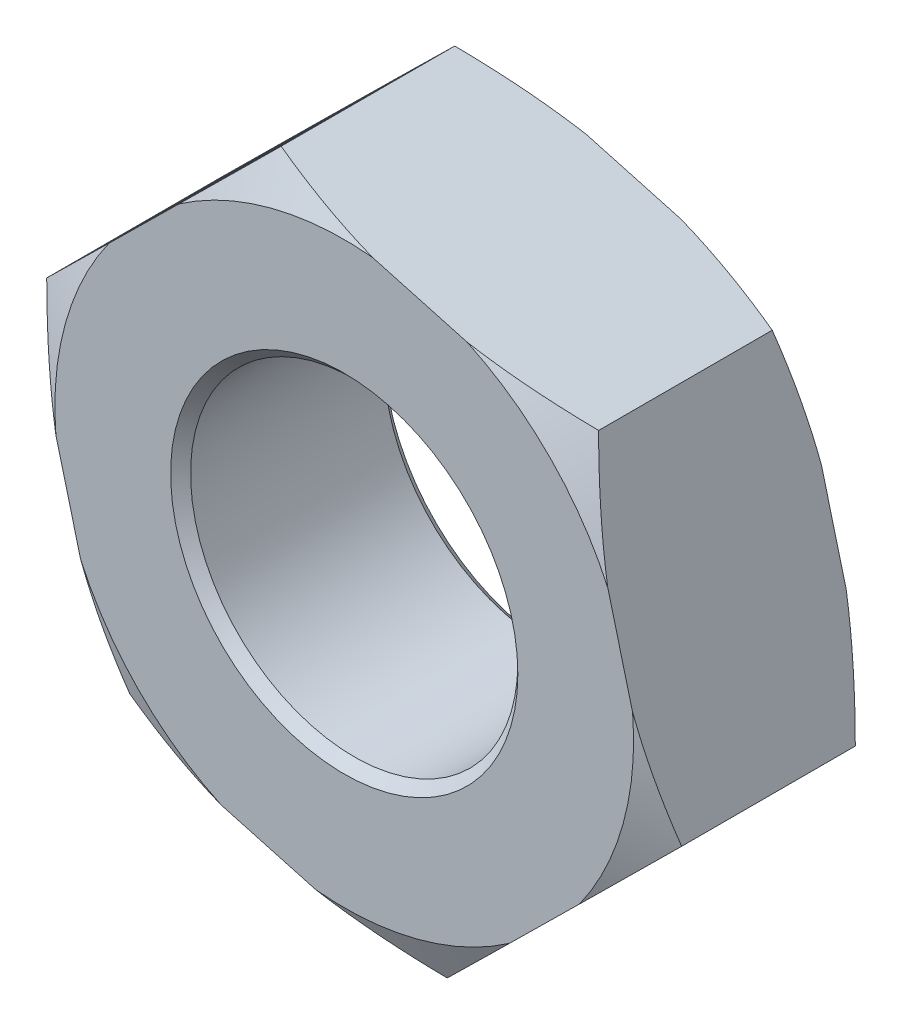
ISO-10303-21;
HEADER;
FILE_DESCRIPTION(('STEP AP214'),'2;1');
FILE_NAME('part.step','',(''),(''),'','','');
FILE_SCHEMA(('AUTOMOTIVE_DESIGN { 1 0 10303 214 1 1 1 1 }'));
ENDSEC;
DATA;
#1=APPLICATION_CONTEXT('core data for automotive mechanical design processes');
#2=APPLICATION_PROTOCOL_DEFINITION('international standard','automotive_design',2000,#1);
#3=PRODUCT_CONTEXT('',#1,'mechanical');
#4=PRODUCT('Part','Part','',(#3));
#5=PRODUCT_RELATED_PRODUCT_CATEGORY('part','',(#4));
#6=PRODUCT_DEFINITION_FORMATION('','',#4);
#7=PRODUCT_DEFINITION_CONTEXT('part definition',#1,'design');
#8=PRODUCT_DEFINITION('design','',#6,#7);
#9=PRODUCT_DEFINITION_SHAPE('','',#8);
#10=(LENGTH_UNIT() NAMED_UNIT(*) SI_UNIT(.MILLI.,.METRE.));
#11=(NAMED_UNIT(*) PLANE_ANGLE_UNIT() SI_UNIT($,.RADIAN.));
#12=(NAMED_UNIT(*) SI_UNIT($,.STERADIAN.) SOLID_ANGLE_UNIT());
#13=UNCERTAINTY_MEASURE_WITH_UNIT(LENGTH_MEASURE(1.E-05),#10,'distance_accuracy_value','');
#14=(GEOMETRIC_REPRESENTATION_CONTEXT(3) GLOBAL_UNCERTAINTY_ASSIGNED_CONTEXT((#13)) GLOBAL_UNIT_ASSIGNED_CONTEXT((#10,
#11,#12)) REPRESENTATION_CONTEXT('',''));
#15=CARTESIAN_POINT('',(0.,0.,0.));
#16=DIRECTION('',(0.,0.,1.));
#17=DIRECTION('',(1.,0.,0.));
#18=AXIS2_PLACEMENT_3D('',#15,#16,#17);
#19=CARTESIAN_POINT('',(0.,0.,5.34999999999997));
#20=DIRECTION('',(0.,0.,1.));
#21=DIRECTION('',(1.,0.,0.));
#22=AXIS2_PLACEMENT_3D('',#19,#20,#21);
#23=PLANE('',#22);
#24=CARTESIAN_POINT('',(0.,0.,5.34999999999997));
#25=DIRECTION('',(0.,0.,1.));
#26=DIRECTION('',(1.,0.,0.));
#27=AXIS2_PLACEMENT_3D('',#24,#25,#26);
#28=CIRCLE('',#27,8.7);
#29=CARTESIAN_POINT('',(8.70000000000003,0.,5.34999999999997));
#30=VERTEX_POINT('',#29);
#31=EDGE_CURVE('E36',#30,#30,#28,.F.);
#32=ORIENTED_EDGE('',*,*,#31,.T.);
#33=EDGE_LOOP('',(#32));
#34=FACE_BOUND('',#33,.T.);
#35=CARTESIAN_POINT('',(0.,0.,5.34999999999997));
#36=DIRECTION('',(0.,0.,1.));
#37=DIRECTION('',(1.,0.,0.));
#38=AXIS2_PLACEMENT_3D('',#35,#36,#37);
#39=CIRCLE('',#38,14.5);
#40=CARTESIAN_POINT('',(11.7876655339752,-8.44398846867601,5.34999999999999));
#41=VERTEX_POINT('',#40);
#42=CARTESIAN_POINT('',(14.4484852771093,1.22117697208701,5.34999999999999));
#43=VERTEX_POINT('',#42);
#44=EDGE_CURVE('E177',#41,#43,#39,.T.);
#45=ORIENTED_EDGE('',*,*,#44,.T.);
#46=DIRECTION('',(-0.252200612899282,0.967674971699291,0.));
#47=VECTOR('',#46,1.);
#48=CARTESIAN_POINT('',(15.9081683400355,-4.37951824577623,5.34999999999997));
#49=LINE('',#48,#47);
#50=CARTESIAN_POINT('',(13.2065412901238,5.98642356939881,5.34999999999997));
#51=VERTEX_POINT('',#50);
#52=EDGE_CURVE('E171',#43,#51,#49,.T.);
#53=ORIENTED_EDGE('',*,*,#52,.T.);
#54=CARTESIAN_POINT('',(6.1666723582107,13.1233437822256,5.34999999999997));
#55=VERTEX_POINT('',#54);
#56=EDGE_CURVE('E169',#51,#55,#39,.T.);
#57=ORIENTED_EDGE('',*,*,#56,.T.);
#58=DIRECTION('',(-0.964131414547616,0.265425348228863,0.));
#59=VECTOR('',#58,1.);
#60=CARTESIAN_POINT('',(11.7468582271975,11.5871187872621,5.34999999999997));
#61=LINE('',#60,#59);
#62=CARTESIAN_POINT('',(1.41887575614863,14.4304120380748,5.34999999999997));
#63=VERTEX_POINT('',#62);
#64=EDGE_CURVE('E43',#55,#63,#61,.T.);
#65=ORIENTED_EDGE('',*,*,#64,.T.);
#66=CARTESIAN_POINT('',(-8.28181291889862,11.9021668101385,5.34999999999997));
#67=VERTEX_POINT('',#66);
#68=EDGE_CURVE('E166',#63,#67,#39,.T.);
#69=ORIENTED_EDGE('',*,*,#68,.T.);
#70=DIRECTION('',(-0.711930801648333,-0.702249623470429,0.));
#71=VECTOR('',#70,1.);
#72=CARTESIAN_POINT('',(-4.16131011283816,15.9666370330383,5.34999999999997));
#73=LINE('',#72,#71);
#74=CARTESIAN_POINT('',(-11.7876655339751,8.443988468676,5.34999999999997));
#75=VERTEX_POINT('',#74);
#76=EDGE_CURVE('E170',#67,#75,#73,.T.);
#77=ORIENTED_EDGE('',*,*,#76,.T.);
#78=CARTESIAN_POINT('',(-14.4484852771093,-1.22117697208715,5.34999999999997));
#79=VERTEX_POINT('',#78);
#80=EDGE_CURVE('E174',#75,#79,#39,.T.);
#81=ORIENTED_EDGE('',*,*,#80,.T.);
#82=DIRECTION('',(0.252200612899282,-0.967674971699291,0.));
#83=VECTOR('',#82,1.);
#84=CARTESIAN_POINT('',(-15.9081683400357,4.37951824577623,5.34999999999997));
#85=LINE('',#84,#83);
#86=CARTESIAN_POINT('',(-13.2065412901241,-5.98642356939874,5.34999999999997));
#87=VERTEX_POINT('',#86);
#88=EDGE_CURVE('E325',#79,#87,#85,.T.);
#89=ORIENTED_EDGE('',*,*,#88,.T.);
#90=CARTESIAN_POINT('',(-6.16667235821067,-13.1233437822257,5.34999999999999));
#91=VERTEX_POINT('',#90);
#92=EDGE_CURVE('E179',#87,#91,#39,.T.);
#93=ORIENTED_EDGE('',*,*,#92,.T.);
#94=DIRECTION('',(0.964131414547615,-0.265425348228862,0.));
#95=VECTOR('',#94,1.);
#96=CARTESIAN_POINT('',(-11.7468582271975,-11.5871187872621,5.34999999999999));
#97=LINE('',#96,#95);
#98=CARTESIAN_POINT('',(-1.41887575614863,-14.4304120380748,5.34999999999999));
#99=VERTEX_POINT('',#98);
#100=EDGE_CURVE('E327',#91,#99,#97,.T.);
#101=ORIENTED_EDGE('',*,*,#100,.T.);
#102=CARTESIAN_POINT('',(8.28181291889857,-11.9021668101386,5.34999999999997));
#103=VERTEX_POINT('',#102);
#104=EDGE_CURVE('E182',#99,#103,#39,.T.);
#105=ORIENTED_EDGE('',*,*,#104,.T.);
#106=DIRECTION('',(0.711930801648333,0.702249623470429,0.));
#107=VECTOR('',#106,1.);
#108=CARTESIAN_POINT('',(4.1613101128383,-15.9666370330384,5.34999999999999));
#109=LINE('',#108,#107);
#110=EDGE_CURVE('E333',#103,#41,#109,.T.);
#111=ORIENTED_EDGE('',*,*,#110,.T.);
#112=EDGE_LOOP('',(#45,#53,#57,#65,#69,#77,#81,#89,#93,#101,#105,#111));
#113=FACE_BOUND('',#112,.T.);
#114=ADVANCED_FACE('F29',(#34,#113),#23,.T.);
#115=CARTESIAN_POINT('',(0.,0.,-5.35000000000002));
#116=DIRECTION('',(0.,0.,1.));
#117=DIRECTION('',(1.,0.,0.));
#118=AXIS2_PLACEMENT_3D('',#115,#116,#117);
#119=PLANE('',#118);
#120=CARTESIAN_POINT('',(0.,0.,-5.35000000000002));
#121=DIRECTION('',(0.,0.,1.));
#122=DIRECTION('',(1.,0.,0.));
#123=AXIS2_PLACEMENT_3D('',#120,#121,#122);
#124=CIRCLE('',#123,8.7);
#125=CARTESIAN_POINT('',(8.69999999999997,0.,-5.35000000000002));
#126=VERTEX_POINT('',#125);
#127=EDGE_CURVE('E11',#126,#126,#124,.T.);
#128=ORIENTED_EDGE('',*,*,#127,.T.);
#129=EDGE_LOOP('',(#128));
#130=FACE_BOUND('',#129,.T.);
#131=DIRECTION('',(-0.252200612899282,0.967674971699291,0.));
#132=VECTOR('',#131,1.);
#133=CARTESIAN_POINT('',(15.9081683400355,-4.37951824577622,-5.35000000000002));
#134=LINE('',#133,#132);
#135=CARTESIAN_POINT('',(14.4484852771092,1.22117697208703,-5.34999999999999));
#136=VERTEX_POINT('',#135);
#137=CARTESIAN_POINT('',(13.2065412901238,5.98642356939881,-5.35000000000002));
#138=VERTEX_POINT('',#137);
#139=EDGE_CURVE('E336',#136,#138,#134,.T.);
#140=ORIENTED_EDGE('',*,*,#139,.F.);
#141=CARTESIAN_POINT('',(0.,0.,-5.35000000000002));
#142=DIRECTION('',(0.,0.,1.));
#143=DIRECTION('',(1.,0.,0.));
#144=AXIS2_PLACEMENT_3D('',#141,#142,#143);
#145=CIRCLE('',#144,14.5);
#146=CARTESIAN_POINT('',(11.7876655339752,-8.44398846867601,-5.34999999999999));
#147=VERTEX_POINT('',#146);
#148=EDGE_CURVE('E176',#136,#147,#145,.F.);
#149=ORIENTED_EDGE('',*,*,#148,.T.);
#150=DIRECTION('',(0.711930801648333,0.702249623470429,0.));
#151=VECTOR('',#150,1.);
#152=CARTESIAN_POINT('',(4.16131011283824,-15.9666370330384,-5.34999999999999));
#153=LINE('',#152,#151);
#154=CARTESIAN_POINT('',(8.28181291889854,-11.9021668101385,-5.35000000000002));
#155=VERTEX_POINT('',#154);
#156=EDGE_CURVE('E345',#155,#147,#153,.T.);
#157=ORIENTED_EDGE('',*,*,#156,.F.);
#158=CARTESIAN_POINT('',(-1.41887575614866,-14.4304120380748,-5.34999999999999));
#159=VERTEX_POINT('',#158);
#160=EDGE_CURVE('E193',#155,#159,#145,.F.);
#161=ORIENTED_EDGE('',*,*,#160,.T.);
#162=DIRECTION('',(0.964131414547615,-0.265425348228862,0.));
#163=VECTOR('',#162,1.);
#164=CARTESIAN_POINT('',(-11.7468582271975,-11.5871187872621,-5.34999999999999));
#165=LINE('',#164,#163);
#166=CARTESIAN_POINT('',(-6.16667235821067,-13.1233437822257,-5.34999999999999));
#167=VERTEX_POINT('',#166);
#168=EDGE_CURVE('E343',#167,#159,#165,.T.);
#169=ORIENTED_EDGE('',*,*,#168,.F.);
#170=CARTESIAN_POINT('',(-13.2065412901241,-5.98642356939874,-5.35000000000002));
#171=VERTEX_POINT('',#170);
#172=EDGE_CURVE('E476',#167,#171,#145,.F.);
#173=ORIENTED_EDGE('',*,*,#172,.T.);
#174=DIRECTION('',(0.252200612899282,-0.967674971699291,0.));
#175=VECTOR('',#174,1.);
#176=CARTESIAN_POINT('',(-15.9081683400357,4.37951824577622,-5.35000000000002));
#177=LINE('',#176,#175);
#178=CARTESIAN_POINT('',(-14.4484852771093,-1.22117697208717,-5.35000000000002));
#179=VERTEX_POINT('',#178);
#180=EDGE_CURVE('E341',#179,#171,#177,.T.);
#181=ORIENTED_EDGE('',*,*,#180,.F.);
#182=CARTESIAN_POINT('',(-11.7876655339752,8.44398846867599,-5.35000000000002));
#183=VERTEX_POINT('',#182);
#184=EDGE_CURVE('E474',#179,#183,#145,.F.);
#185=ORIENTED_EDGE('',*,*,#184,.T.);
#186=DIRECTION('',(-0.711930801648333,-0.702249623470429,0.));
#187=VECTOR('',#186,1.);
#188=CARTESIAN_POINT('',(-4.16131011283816,15.9666370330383,-5.35000000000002));
#189=LINE('',#188,#187);
#190=CARTESIAN_POINT('',(-8.28181291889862,11.9021668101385,-5.35000000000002));
#191=VERTEX_POINT('',#190);
#192=EDGE_CURVE('E339',#191,#183,#189,.T.);
#193=ORIENTED_EDGE('',*,*,#192,.F.);
#194=CARTESIAN_POINT('',(1.41887575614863,14.4304120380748,-5.35000000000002));
#195=VERTEX_POINT('',#194);
#196=EDGE_CURVE('E467',#191,#195,#145,.F.);
#197=ORIENTED_EDGE('',*,*,#196,.T.);
#198=DIRECTION('',(-0.964131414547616,0.265425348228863,0.));
#199=VECTOR('',#198,1.);
#200=CARTESIAN_POINT('',(11.7468582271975,11.5871187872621,-5.34999999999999));
#201=LINE('',#200,#199);
#202=CARTESIAN_POINT('',(6.16667235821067,13.1233437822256,-5.34999999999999));
#203=VERTEX_POINT('',#202);
#204=EDGE_CURVE('E50',#203,#195,#201,.T.);
#205=ORIENTED_EDGE('',*,*,#204,.F.);
#206=EDGE_CURVE('E192',#203,#138,#145,.F.);
#207=ORIENTED_EDGE('',*,*,#206,.T.);
#208=EDGE_LOOP('',(#140,#149,#157,#161,#169,#173,#181,#185,#193,#197,#205,#207));
#209=FACE_BOUND('',#208,.T.);
#210=ADVANCED_FACE('F242',(#130,#209),#119,.F.);
#211=CARTESIAN_POINT('',(0.,0.,5.34999999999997));
#212=DIRECTION('',(0.,0.,-1.));
#213=DIRECTION('',(-1.,0.,0.));
#214=AXIS2_PLACEMENT_3D('',#211,#212,#213);
#215=CONICAL_SURFACE('',#214,14.5,1.10714871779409);
#216=CARTESIAN_POINT('',(11.7859877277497,-8.44564345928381,5.35019999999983));
#217=CARTESIAN_POINT('',(11.9600449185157,-8.27395318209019,5.32946718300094));
#218=CARTESIAN_POINT('',(12.1339120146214,-8.10245041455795,5.30574212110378));
#219=CARTESIAN_POINT('',(12.4811907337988,-7.75989415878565,5.25256007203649));
#220=CARTESIAN_POINT('',(12.6546023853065,-7.58884064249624,5.22310345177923));
#221=CARTESIAN_POINT('',(13.1735019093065,-7.07699736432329,5.12661697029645));
#222=CARTESIAN_POINT('',(13.5182304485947,-6.7369566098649,5.05140022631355));
#223=CARTESIAN_POINT('',(14.2051006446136,-6.05942680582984,4.88155589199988));
#224=CARTESIAN_POINT('',(14.5472430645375,-5.72193700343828,4.78693428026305));
#225=CARTESIAN_POINT('',(15.229498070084,-5.0489596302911,4.58061070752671));
#226=CARTESIAN_POINT('',(15.5696064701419,-4.71347618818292,4.46888132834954));
#227=CARTESIAN_POINT('',(15.9083683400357,-4.37932096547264,4.34992976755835));
#228=B_SPLINE_CURVE_WITH_KNOTS('',3,(#216,#217,#218,#219,#220,#221,#222,#223,#224,#225,#226,
#227),.UNSPECIFIED.,.F.,.F.,(4,2,2,2,2,4),(0.,0.736049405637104,1.47205170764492,
2.94162190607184,4.41074001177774,5.88223776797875),.UNSPECIFIED.);
#229=CARTESIAN_POINT('',(15.9081683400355,-4.37951824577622,4.34999999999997));
#230=VERTEX_POINT('',#229);
#231=EDGE_CURVE('E293',#41,#230,#228,.T.);
#232=ORIENTED_EDGE('',*,*,#231,.T.);
#233=CARTESIAN_POINT('',(15.9082204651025,-4.37971824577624,4.34994832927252));
#234=CARTESIAN_POINT('',(15.7882160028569,-3.91927006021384,4.46889758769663));
#235=CARTESIAN_POINT('',(15.6677345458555,-3.4569916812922,4.58062478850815));
#236=CARTESIAN_POINT('',(15.4260496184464,-2.52966461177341,4.78694435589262));
#237=CARTESIAN_POINT('',(15.3048476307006,-2.06462161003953,4.88156413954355));
#238=CARTESIAN_POINT('',(15.0615278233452,-1.13102162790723,5.05140525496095));
#239=CARTESIAN_POINT('',(14.9394097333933,-0.662463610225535,5.12662060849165));
#240=CARTESIAN_POINT('',(14.7555925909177,0.0428290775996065,5.22310540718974));
#241=CARTESIAN_POINT('',(14.6941625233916,0.278531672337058,5.25256153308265));
#242=CARTESIAN_POINT('',(14.5711410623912,0.750555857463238,5.30574273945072));
#243=CARTESIAN_POINT('',(14.509549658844,0.986877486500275,5.32946745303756));
#244=CARTESIAN_POINT('',(14.4478909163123,1.22345749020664,5.3502));
#245=B_SPLINE_CURVE_WITH_KNOTS('',3,(#233,#234,#235,#236,#237,#238,#239,#240,#241,#242,#243,
#244),.UNSPECIFIED.,.F.,.F.,(4,2,2,2,2,4),(0.,1.47147859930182,2.94057762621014,
4.41012872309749,5.14612143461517,5.88216124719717),.UNSPECIFIED.);
#246=EDGE_CURVE('E297',#230,#43,#245,.T.);
#247=ORIENTED_EDGE('',*,*,#246,.T.);
#248=ORIENTED_EDGE('',*,*,#44,.F.);
#249=EDGE_LOOP('',(#232,#247,#248));
#250=FACE_BOUND('',#249,.T.);
#251=ADVANCED_FACE('F237',(#250),#215,.T.);
#252=CARTESIAN_POINT('',(-1.42114792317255,-14.4297865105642,5.3502));
#253=CARTESIAN_POINT('',(-1.18543422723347,-14.4946784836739,5.32946745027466));
#254=CARTESIAN_POINT('',(-0.949977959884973,-14.5594995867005,5.3057427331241));
#255=CARTESIAN_POINT('',(-0.479682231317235,-14.6889719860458,5.25256151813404));
#256=CARTESIAN_POINT('',(-0.244842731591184,-14.7536232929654,5.22310538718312));
#257=CARTESIAN_POINT('',(0.457867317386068,-14.9470793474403,5.12662057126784));
#258=CARTESIAN_POINT('',(0.924709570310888,-15.0756010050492,5.05140520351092));
#259=CARTESIAN_POINT('',(1.85489089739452,-15.3316798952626,4.88156405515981));
#260=CARTESIAN_POINT('',(2.31823100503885,-15.4592374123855,4.78694425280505));
#261=CARTESIAN_POINT('',(3.24216238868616,-15.7135956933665,4.58062464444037));
#262=CARTESIAN_POINT('',(3.70274799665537,-15.8403948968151,4.46889742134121));
#263=CARTESIAN_POINT('',(4.16151011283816,-15.9666920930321,4.34994813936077));
#264=B_SPLINE_CURVE_WITH_KNOTS('',3,(#252,#253,#254,#255,#256,#257,#258,#259,#260,#261,#262,
#263),.UNSPECIFIED.,.F.,.F.,(4,2,2,2,2,4),(0.,0.736039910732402,1.47203272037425,
2.94158401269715,4.41068323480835,5.88216203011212),.UNSPECIFIED.);
#265=CARTESIAN_POINT('',(4.1613101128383,-15.9666370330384,4.34999999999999));
#266=VERTEX_POINT('',#265);
#267=EDGE_CURVE('E281',#99,#266,#264,.T.);
#268=ORIENTED_EDGE('',*,*,#267,.T.);
#269=CARTESIAN_POINT('',(4.16111011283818,-15.9668343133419,4.34992976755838));
#270=CARTESIAN_POINT('',(4.49987198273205,-15.6326790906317,4.46888132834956));
#271=CARTESIAN_POINT('',(4.83998038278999,-15.2971956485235,4.58061070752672));
#272=CARTESIAN_POINT('',(5.52223538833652,-14.6242182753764,4.78693428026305));
#273=CARTESIAN_POINT('',(5.86437780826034,-14.2867284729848,4.88155589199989));
#274=CARTESIAN_POINT('',(6.55124800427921,-13.6091986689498,5.05140022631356));
#275=CARTESIAN_POINT('',(6.89597654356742,-13.2691579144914,5.12661697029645));
#276=CARTESIAN_POINT('',(7.41487606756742,-12.7573146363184,5.22310345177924));
#277=CARTESIAN_POINT('',(7.58828771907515,-12.586261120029,5.25256007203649));
#278=CARTESIAN_POINT('',(7.93556643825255,-12.2437048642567,5.30574212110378));
#279=CARTESIAN_POINT('',(8.10943353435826,-12.0722020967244,5.32946718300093));
#280=CARTESIAN_POINT('',(8.28349072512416,-11.9005118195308,5.35019999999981));
#281=B_SPLINE_CURVE_WITH_KNOTS('',3,(#269,#270,#271,#272,#273,#274,#275,#276,#277,#278,#279,
#280),.UNSPECIFIED.,.F.,.F.,(4,2,2,2,2,4),(0.,1.471497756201,2.94061586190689,4.4101860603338,
5.14618836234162,5.88223776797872),.UNSPECIFIED.);
#282=EDGE_CURVE('E287',#266,#103,#281,.T.);
#283=ORIENTED_EDGE('',*,*,#282,.T.);
#284=ORIENTED_EDGE('',*,*,#104,.F.);
#285=EDGE_LOOP('',(#268,#283,#284));
#286=FACE_BOUND('',#285,.T.);
#287=ADVANCED_FACE('F241',(#286),#215,.T.);
#288=CARTESIAN_POINT('',(-13.207135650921,-5.98414305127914,5.35019999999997));
#289=CARTESIAN_POINT('',(-13.1454769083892,-6.22072305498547,5.32946745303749));
#290=CARTESIAN_POINT('',(-13.083885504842,-6.45704468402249,5.30574273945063));
#291=CARTESIAN_POINT('',(-12.9608640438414,-6.92906886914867,5.25256153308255));
#292=CARTESIAN_POINT('',(-12.8994339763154,-7.16477146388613,5.22310540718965));
#293=CARTESIAN_POINT('',(-12.7156168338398,-7.87006415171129,5.12662060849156));
#294=CARTESIAN_POINT('',(-12.5934987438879,-8.33862216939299,5.05140525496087));
#295=CARTESIAN_POINT('',(-12.3501789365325,-9.27222215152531,4.88156413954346));
#296=CARTESIAN_POINT('',(-12.2289769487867,-9.73726515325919,4.78694435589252));
#297=CARTESIAN_POINT('',(-11.9872920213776,-10.664592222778,4.58062478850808));
#298=CARTESIAN_POINT('',(-11.8668105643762,-11.1268706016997,4.46889758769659));
#299=CARTESIAN_POINT('',(-11.7468061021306,-11.5873187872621,4.34994832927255));
#300=B_SPLINE_CURVE_WITH_KNOTS('',3,(#288,#289,#290,#291,#292,#293,#294,#295,#296,#297,#298,
#299),.UNSPECIFIED.,.F.,.F.,(4,2,2,2,2,4),(0.,0.736039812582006,1.4720325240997,
2.94158362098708,4.41068264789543,5.88216124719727),.UNSPECIFIED.);
#301=CARTESIAN_POINT('',(-11.7468582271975,-11.5871187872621,4.34999999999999));
#302=VERTEX_POINT('',#301);
#303=EDGE_CURVE('E268',#87,#302,#300,.T.);
#304=ORIENTED_EDGE('',*,*,#303,.T.);
#305=CARTESIAN_POINT('',(-11.7470582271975,-11.5870637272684,4.34994813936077));
#306=CARTESIAN_POINT('',(-11.2882961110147,-11.7133609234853,4.4688974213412));
#307=CARTESIAN_POINT('',(-10.8277105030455,-11.8401601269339,4.58062464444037));
#308=CARTESIAN_POINT('',(-9.90377911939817,-12.094518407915,4.78694425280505));
#309=CARTESIAN_POINT('',(-9.44043901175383,-12.2220759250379,4.88156405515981));
#310=CARTESIAN_POINT('',(-8.51025768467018,-12.4781548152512,5.05140520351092));
#311=CARTESIAN_POINT('',(-8.04341543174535,-12.6066764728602,5.12662057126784));
#312=CARTESIAN_POINT('',(-7.34070538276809,-12.8001325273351,5.22310538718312));
#313=CARTESIAN_POINT('',(-7.10586588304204,-12.8647838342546,5.25256151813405));
#314=CARTESIAN_POINT('',(-6.63557015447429,-12.9942562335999,5.30574273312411));
#315=CARTESIAN_POINT('',(-6.40011388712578,-13.0590773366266,5.32946745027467));
#316=CARTESIAN_POINT('',(-6.16440019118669,-13.1239693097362,5.3502));
#317=B_SPLINE_CURVE_WITH_KNOTS('',3,(#305,#306,#307,#308,#309,#310,#311,#312,#313,#314,#315,
#316),.UNSPECIFIED.,.F.,.F.,(4,2,2,2,2,4),(0.,1.4714787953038,2.94057801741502,4.41012930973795,
5.14612211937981,5.88216203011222),.UNSPECIFIED.);
#318=EDGE_CURVE('E274',#302,#91,#317,.T.);
#319=ORIENTED_EDGE('',*,*,#318,.T.);
#320=ORIENTED_EDGE('',*,*,#92,.F.);
#321=EDGE_LOOP('',(#304,#319,#320));
#322=FACE_BOUND('',#321,.T.);
#323=ADVANCED_FACE('F497',(#322),#215,.T.);
#324=CARTESIAN_POINT('',(-11.7859877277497,8.44564345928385,5.35019999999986));
#325=CARTESIAN_POINT('',(-11.9600449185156,8.27395318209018,5.32946718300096));
#326=CARTESIAN_POINT('',(-12.1339120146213,8.10245041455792,5.3057421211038));
#327=CARTESIAN_POINT('',(-12.4811907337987,7.75989415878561,5.25256007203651));
#328=CARTESIAN_POINT('',(-12.6546023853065,7.5888406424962,5.22310345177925));
#329=CARTESIAN_POINT('',(-13.1735019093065,7.07699736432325,5.12661697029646));
#330=CARTESIAN_POINT('',(-13.5182304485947,6.73695660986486,5.05140022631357));
#331=CARTESIAN_POINT('',(-14.2051006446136,6.05942680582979,4.8815558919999));
#332=CARTESIAN_POINT('',(-14.5472430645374,5.72193700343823,4.78693428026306));
#333=CARTESIAN_POINT('',(-15.2294980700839,5.04895963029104,4.58061070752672));
#334=CARTESIAN_POINT('',(-15.5696064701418,4.71347618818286,4.46888132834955));
#335=CARTESIAN_POINT('',(-15.9083683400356,4.37932096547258,4.34992976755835));
#336=B_SPLINE_CURVE_WITH_KNOTS('',3,(#324,#325,#326,#327,#328,#329,#330,#331,#332,#333,#334,
#335),.UNSPECIFIED.,.F.,.F.,(4,2,2,2,2,4),(0.,0.736049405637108,1.47205170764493,
2.94162190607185,4.41074001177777,5.88223776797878),.UNSPECIFIED.);
#337=CARTESIAN_POINT('',(-15.9081683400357,4.37951824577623,4.34999999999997));
#338=VERTEX_POINT('',#337);
#339=EDGE_CURVE('E256',#75,#338,#336,.T.);
#340=ORIENTED_EDGE('',*,*,#339,.T.);
#341=CARTESIAN_POINT('',(-15.9082204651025,4.37971824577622,4.34994832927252));
#342=CARTESIAN_POINT('',(-15.788216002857,3.91927006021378,4.46889758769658));
#343=CARTESIAN_POINT('',(-15.6677345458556,3.45699168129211,4.58062478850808));
#344=CARTESIAN_POINT('',(-15.4260496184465,2.5296646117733,4.78694435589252));
#345=CARTESIAN_POINT('',(-15.3048476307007,2.06462161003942,4.88156413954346));
#346=CARTESIAN_POINT('',(-15.0615278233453,1.13102162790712,5.05140525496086));
#347=CARTESIAN_POINT('',(-14.9394097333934,0.662463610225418,5.12662060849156));
#348=CARTESIAN_POINT('',(-14.7555925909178,-0.0428290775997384,5.22310540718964));
#349=CARTESIAN_POINT('',(-14.6941625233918,-0.278531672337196,5.25256153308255));
#350=CARTESIAN_POINT('',(-14.5711410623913,-0.750555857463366,5.30574273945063));
#351=CARTESIAN_POINT('',(-14.509549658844,-0.986877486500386,5.32946745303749));
#352=CARTESIAN_POINT('',(-14.4478909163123,-1.22345749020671,5.35019999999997));
#353=B_SPLINE_CURVE_WITH_KNOTS('',3,(#341,#342,#343,#344,#345,#346,#347,#348,#349,#350,#351,
#352),.UNSPECIFIED.,.F.,.F.,(4,2,2,2,2,4),(0.,1.47147859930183,2.94057762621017,
4.41012872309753,5.14612143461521,5.88216124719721),.UNSPECIFIED.);
#354=EDGE_CURVE('E262',#338,#79,#353,.T.);
#355=ORIENTED_EDGE('',*,*,#354,.T.);
#356=ORIENTED_EDGE('',*,*,#80,.F.);
#357=EDGE_LOOP('',(#340,#355,#356));
#358=FACE_BOUND('',#357,.T.);
#359=ADVANCED_FACE('F319',(#358),#215,.T.);
#360=CARTESIAN_POINT('',(1.42114792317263,14.4297865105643,5.35019999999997));
#361=CARTESIAN_POINT('',(1.18543422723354,14.4946784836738,5.32946745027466));
#362=CARTESIAN_POINT('',(0.949977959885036,14.5594995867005,5.30574273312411));
#363=CARTESIAN_POINT('',(0.47968223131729,14.6889719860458,5.25256151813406));
#364=CARTESIAN_POINT('',(0.244842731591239,14.7536232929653,5.22310538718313));
#365=CARTESIAN_POINT('',(-0.457867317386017,14.9470793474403,5.12662057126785));
#366=CARTESIAN_POINT('',(-0.924709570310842,15.0756010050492,5.05140520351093));
#367=CARTESIAN_POINT('',(-1.85489089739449,15.3316798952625,4.88156405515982));
#368=CARTESIAN_POINT('',(-2.31823100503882,15.4592374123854,4.78694425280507));
#369=CARTESIAN_POINT('',(-3.24216238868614,15.7135956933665,4.58062464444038));
#370=CARTESIAN_POINT('',(-3.70274799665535,15.8403948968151,4.4688974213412));
#371=CARTESIAN_POINT('',(-4.16151011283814,15.9666920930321,4.34994813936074));
#372=B_SPLINE_CURVE_WITH_KNOTS('',3,(#360,#361,#362,#363,#364,#365,#366,#367,#368,#369,#370,
#371),.UNSPECIFIED.,.F.,.F.,(4,2,2,2,2,4),(0.,0.73603991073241,1.47203272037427,
2.94158401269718,4.41068323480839,5.88216203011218),.UNSPECIFIED.);
#373=CARTESIAN_POINT('',(-4.16131011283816,15.9666370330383,4.34999999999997));
#374=VERTEX_POINT('',#373);
#375=EDGE_CURVE('E151',#63,#374,#372,.T.);
#376=ORIENTED_EDGE('',*,*,#375,.T.);
#377=CARTESIAN_POINT('',(-4.16111011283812,15.9668343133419,4.34992976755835));
#378=CARTESIAN_POINT('',(-4.49987198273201,15.6326790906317,4.46888132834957));
#379=CARTESIAN_POINT('',(-4.83998038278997,15.2971956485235,4.58061070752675));
#380=CARTESIAN_POINT('',(-5.52223538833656,14.6242182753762,4.78693428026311));
#381=CARTESIAN_POINT('',(-5.86437780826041,14.2867284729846,4.88155589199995));
#382=CARTESIAN_POINT('',(-6.55124800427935,13.6091986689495,5.05140022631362));
#383=CARTESIAN_POINT('',(-6.8959765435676,13.2691579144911,5.12661697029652));
#384=CARTESIAN_POINT('',(-7.41487606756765,12.7573146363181,5.22310345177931));
#385=CARTESIAN_POINT('',(-7.58828771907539,12.5862611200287,5.25256007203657));
#386=CARTESIAN_POINT('',(-7.93556643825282,12.2437048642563,5.30574212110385));
#387=CARTESIAN_POINT('',(-8.10943353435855,12.072202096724,5.32946718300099));
#388=CARTESIAN_POINT('',(-8.28349072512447,11.9005118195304,5.35019999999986));
#389=B_SPLINE_CURVE_WITH_KNOTS('',3,(#377,#378,#379,#380,#381,#382,#383,#384,#385,#386,#387,
#388),.UNSPECIFIED.,.F.,.F.,(4,2,2,2,2,4),(0.,1.47149775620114,2.94061586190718,
4.41018606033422,5.14618836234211,5.88223776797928),.UNSPECIFIED.);
#390=EDGE_CURVE('E158',#374,#67,#389,.T.);
#391=ORIENTED_EDGE('',*,*,#390,.T.);
#392=ORIENTED_EDGE('',*,*,#68,.F.);
#393=EDGE_LOOP('',(#376,#391,#392));
#394=FACE_BOUND('',#393,.T.);
#395=ADVANCED_FACE('F173',(#394),#215,.T.);
#396=ORIENTED_EDGE('',*,*,#56,.F.);
#397=CARTESIAN_POINT('',(13.207135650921,5.98414305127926,5.35019999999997));
#398=CARTESIAN_POINT('',(13.1454769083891,6.22072305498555,5.32946745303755));
#399=CARTESIAN_POINT('',(13.0838855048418,6.45704468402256,5.30574273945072));
#400=CARTESIAN_POINT('',(12.9608640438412,6.92906886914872,5.25256153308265));
#401=CARTESIAN_POINT('',(12.8994339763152,7.16477146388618,5.22310540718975));
#402=CARTESIAN_POINT('',(12.7156168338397,7.87006415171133,5.12662060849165));
#403=CARTESIAN_POINT('',(12.5934987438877,8.33862216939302,5.05140525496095));
#404=CARTESIAN_POINT('',(12.3501789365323,9.27222215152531,4.88156413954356));
#405=CARTESIAN_POINT('',(12.2289769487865,9.73726515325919,4.78694435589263));
#406=CARTESIAN_POINT('',(11.9872920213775,10.664592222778,4.58062478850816));
#407=CARTESIAN_POINT('',(11.8668105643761,11.1268706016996,4.46889758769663));
#408=CARTESIAN_POINT('',(11.7468061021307,11.5873187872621,4.34994832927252));
#409=B_SPLINE_CURVE_WITH_KNOTS('',3,(#397,#398,#399,#400,#401,#402,#403,#404,#405,#406,#407,
#408),.UNSPECIFIED.,.F.,.F.,(4,2,2,2,2,4),(0.,0.736039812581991,1.47203252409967,
2.94158362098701,4.41068264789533,5.88216124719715),.UNSPECIFIED.);
#410=CARTESIAN_POINT('',(11.7468582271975,11.5871187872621,4.34999999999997));
#411=VERTEX_POINT('',#410);
#412=EDGE_CURVE('E183',#51,#411,#409,.T.);
#413=ORIENTED_EDGE('',*,*,#412,.T.);
#414=CARTESIAN_POINT('',(11.7470582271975,11.5870637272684,4.34994813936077));
#415=CARTESIAN_POINT('',(11.2882961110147,11.7133609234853,4.46889742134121));
#416=CARTESIAN_POINT('',(10.8277105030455,11.8401601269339,4.58062464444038));
#417=CARTESIAN_POINT('',(9.90377911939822,12.0945184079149,4.78694425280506));
#418=CARTESIAN_POINT('',(9.4404390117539,12.2220759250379,4.88156405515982));
#419=CARTESIAN_POINT('',(8.51025768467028,12.4781548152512,5.05140520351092));
#420=CARTESIAN_POINT('',(8.04341543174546,12.6066764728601,5.12662057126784));
#421=CARTESIAN_POINT('',(7.34070538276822,12.800132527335,5.22310538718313));
#422=CARTESIAN_POINT('',(7.10586588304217,12.8647838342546,5.25256151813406));
#423=CARTESIAN_POINT('',(6.63557015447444,12.9942562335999,5.30574273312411));
#424=CARTESIAN_POINT('',(6.40011388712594,13.0590773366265,5.32946745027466));
#425=CARTESIAN_POINT('',(6.16440019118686,13.1239693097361,5.35019999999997));
#426=B_SPLINE_CURVE_WITH_KNOTS('',3,(#414,#415,#416,#417,#418,#419,#420,#421,#422,#423,#424,
#425),.UNSPECIFIED.,.F.,.F.,(4,2,2,2,2,4),(0.,1.47147879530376,2.94057801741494,
4.41012930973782,5.14612211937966,5.88216203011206),.UNSPECIFIED.);
#427=EDGE_CURVE('E159',#411,#55,#426,.T.);
#428=ORIENTED_EDGE('',*,*,#427,.T.);
#429=EDGE_LOOP('',(#396,#413,#428));
#430=FACE_BOUND('',#429,.T.);
#431=ADVANCED_FACE('F244',(#430),#215,.T.);
#432=CARTESIAN_POINT('',(0.,0.,-4.35000000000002));
#433=DIRECTION('',(0.,0.,1.));
#434=DIRECTION('',(1.,0.,0.));
#435=AXIS2_PLACEMENT_3D('',#432,#433,#434);
#436=CONICAL_SURFACE('',#435,16.5,1.10714871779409);
#437=ORIENTED_EDGE('',*,*,#148,.F.);
#438=CARTESIAN_POINT('',(14.4478909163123,1.22345749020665,-5.3502));
#439=CARTESIAN_POINT('',(14.509549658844,0.986877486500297,-5.32946745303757));
#440=CARTESIAN_POINT('',(14.5711410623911,0.750555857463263,-5.30574273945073));
#441=CARTESIAN_POINT('',(14.6941625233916,0.278531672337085,-5.25256153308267));
#442=CARTESIAN_POINT('',(14.7555925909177,0.042829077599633,-5.22310540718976));
#443=CARTESIAN_POINT('',(14.9394097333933,-0.662463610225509,-5.12662060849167));
#444=CARTESIAN_POINT('',(15.0615278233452,-1.1310216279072,-5.05140525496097));
#445=CARTESIAN_POINT('',(15.3048476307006,-2.0646216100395,-4.88156413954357));
#446=CARTESIAN_POINT('',(15.4260496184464,-2.52966461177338,-4.78694435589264));
#447=CARTESIAN_POINT('',(15.6677345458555,-3.45699168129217,-4.58062478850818));
#448=CARTESIAN_POINT('',(15.7882160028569,-3.91927006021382,-4.46889758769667));
#449=CARTESIAN_POINT('',(15.9082204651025,-4.37971824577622,-4.34994832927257));
#450=B_SPLINE_CURVE_WITH_KNOTS('',3,(#438,#439,#440,#441,#442,#443,#444,#445,#446,#447,#448,
#449),.UNSPECIFIED.,.F.,.F.,(4,2,2,2,2,4),(0.,0.736039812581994,1.47203252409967,
2.94158362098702,4.41068264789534,5.88216124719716),.UNSPECIFIED.);
#451=CARTESIAN_POINT('',(15.9081683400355,-4.37951824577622,-4.35000000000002));
#452=VERTEX_POINT('',#451);
#453=EDGE_CURVE('E386',#136,#452,#450,.T.);
#454=ORIENTED_EDGE('',*,*,#453,.T.);
#455=CARTESIAN_POINT('',(15.9083683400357,-4.37932096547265,-4.34992976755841));
#456=CARTESIAN_POINT('',(15.5696064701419,-4.71347618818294,-4.46888132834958));
#457=CARTESIAN_POINT('',(15.2294980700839,-5.04895963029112,-4.58061070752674));
#458=CARTESIAN_POINT('',(14.5472430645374,-5.7219370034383,-4.78693428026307));
#459=CARTESIAN_POINT('',(14.2051006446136,-6.05942680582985,-4.88155589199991));
#460=CARTESIAN_POINT('',(13.5182304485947,-6.7369566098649,-5.05140022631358));
#461=CARTESIAN_POINT('',(13.1735019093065,-7.07699736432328,-5.12661697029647));
#462=CARTESIAN_POINT('',(12.6546023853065,-7.58884064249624,-5.22310345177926));
#463=CARTESIAN_POINT('',(12.4811907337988,-7.75989415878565,-5.25256007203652));
#464=CARTESIAN_POINT('',(12.1339120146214,-8.10245041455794,-5.3057421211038));
#465=CARTESIAN_POINT('',(11.9600449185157,-8.27395318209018,-5.32946718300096));
#466=CARTESIAN_POINT('',(11.7859877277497,-8.44564345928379,-5.35019999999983));
#467=B_SPLINE_CURVE_WITH_KNOTS('',3,(#455,#456,#457,#458,#459,#460,#461,#462,#463,#464,#465,
#466),.UNSPECIFIED.,.F.,.F.,(4,2,2,2,2,4),(0.,1.47149775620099,2.94061586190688,
4.41018606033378,5.1461883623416,5.8822377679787),.UNSPECIFIED.);
#468=EDGE_CURVE('E392',#452,#147,#467,.T.);
#469=ORIENTED_EDGE('',*,*,#468,.T.);
#470=EDGE_LOOP('',(#437,#454,#469));
#471=FACE_BOUND('',#470,.T.);
#472=ADVANCED_FACE('F207',(#471),#436,.T.);
#473=ORIENTED_EDGE('',*,*,#160,.F.);
#474=CARTESIAN_POINT('',(8.28349072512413,-11.9005118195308,-5.35019999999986));
#475=CARTESIAN_POINT('',(8.10943353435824,-12.0722020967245,-5.32946718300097));
#476=CARTESIAN_POINT('',(7.93556643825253,-12.2437048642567,-5.30574212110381));
#477=CARTESIAN_POINT('',(7.58828771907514,-12.586261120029,-5.25256007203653));
#478=CARTESIAN_POINT('',(7.41487606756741,-12.7573146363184,-5.22310345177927));
#479=CARTESIAN_POINT('',(6.89597654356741,-13.2691579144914,-5.12661697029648));
#480=CARTESIAN_POINT('',(6.55124800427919,-13.6091986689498,-5.05140022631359));
#481=CARTESIAN_POINT('',(5.86437780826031,-14.2867284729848,-4.88155589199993));
#482=CARTESIAN_POINT('',(5.5222353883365,-14.6242182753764,-4.78693428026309));
#483=CARTESIAN_POINT('',(4.83998038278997,-15.2971956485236,-4.58061070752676));
#484=CARTESIAN_POINT('',(4.49987198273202,-15.6326790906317,-4.46888132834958));
#485=CARTESIAN_POINT('',(4.16111011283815,-15.9668343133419,-4.34992976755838));
#486=B_SPLINE_CURVE_WITH_KNOTS('',3,(#474,#475,#476,#477,#478,#479,#480,#481,#482,#483,#484,
#485),.UNSPECIFIED.,.F.,.F.,(4,2,2,2,2,4),(0.,0.736049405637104,1.47205170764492,
2.94162190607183,4.41074001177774,5.88223776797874),.UNSPECIFIED.);
#487=CARTESIAN_POINT('',(4.16131011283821,-15.9666370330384,-4.34999999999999));
#488=VERTEX_POINT('',#487);
#489=EDGE_CURVE('E398',#155,#488,#486,.T.);
#490=ORIENTED_EDGE('',*,*,#489,.T.);
#491=CARTESIAN_POINT('',(4.16151011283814,-15.9666920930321,-4.34994813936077));
#492=CARTESIAN_POINT('',(3.70274799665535,-15.8403948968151,-4.46889742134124));
#493=CARTESIAN_POINT('',(3.24216238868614,-15.7135956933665,-4.58062464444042));
#494=CARTESIAN_POINT('',(2.31823100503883,-15.4592374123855,-4.78694425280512));
#495=CARTESIAN_POINT('',(1.85489089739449,-15.3316798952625,-4.88156405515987));
#496=CARTESIAN_POINT('',(0.924709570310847,-15.0756010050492,-5.05140520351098));
#497=CARTESIAN_POINT('',(0.457867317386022,-14.9470793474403,-5.1266205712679));
#498=CARTESIAN_POINT('',(-0.244842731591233,-14.7536232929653,-5.22310538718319));
#499=CARTESIAN_POINT('',(-0.479682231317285,-14.6889719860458,-5.25256151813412));
#500=CARTESIAN_POINT('',(-0.949977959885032,-14.5594995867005,-5.30574273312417));
#501=CARTESIAN_POINT('',(-1.18543422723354,-14.4946784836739,-5.32946745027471));
#502=CARTESIAN_POINT('',(-1.42114792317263,-14.4297865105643,-5.3502));
#503=B_SPLINE_CURVE_WITH_KNOTS('',3,(#491,#492,#493,#494,#495,#496,#497,#498,#499,#500,#501,
#502),.UNSPECIFIED.,.F.,.F.,(4,2,2,2,2,4),(0.,1.47147879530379,2.940578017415,4.41012930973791,
5.14612211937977,5.88216203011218),.UNSPECIFIED.);
#504=EDGE_CURVE('E427',#488,#159,#503,.T.);
#505=ORIENTED_EDGE('',*,*,#504,.T.);
#506=EDGE_LOOP('',(#473,#490,#505));
#507=FACE_BOUND('',#506,.T.);
#508=ADVANCED_FACE('F367',(#507),#436,.T.);
#509=ORIENTED_EDGE('',*,*,#172,.F.);
#510=CARTESIAN_POINT('',(-6.16440019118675,-13.1239693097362,-5.3502));
#511=CARTESIAN_POINT('',(-6.40011388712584,-13.0590773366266,-5.32946745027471));
#512=CARTESIAN_POINT('',(-6.63557015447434,-12.9942562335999,-5.30574273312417));
#513=CARTESIAN_POINT('',(-7.10586588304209,-12.8647838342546,-5.25256151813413));
#514=CARTESIAN_POINT('',(-7.34070538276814,-12.8001325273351,-5.2231053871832));
#515=CARTESIAN_POINT('',(-8.04341543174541,-12.6066764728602,-5.12662057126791));
#516=CARTESIAN_POINT('',(-8.51025768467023,-12.4781548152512,-5.05140520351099));
#517=CARTESIAN_POINT('',(-9.44043901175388,-12.2220759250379,-4.88156405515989));
#518=CARTESIAN_POINT('',(-9.90377911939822,-12.094518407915,-4.78694425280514));
#519=CARTESIAN_POINT('',(-10.8277105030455,-11.8401601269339,-4.58062464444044));
#520=CARTESIAN_POINT('',(-11.2882961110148,-11.7133609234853,-4.46889742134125));
#521=CARTESIAN_POINT('',(-11.7470582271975,-11.5870637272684,-4.34994813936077));
#522=B_SPLINE_CURVE_WITH_KNOTS('',3,(#510,#511,#512,#513,#514,#515,#516,#517,#518,#519,#520,
#521),.UNSPECIFIED.,.F.,.F.,(4,2,2,2,2,4),(0.,0.736039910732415,1.47203272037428,
2.94158401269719,4.41068323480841,5.88216203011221),.UNSPECIFIED.);
#523=CARTESIAN_POINT('',(-11.7468582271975,-11.5871187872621,-4.34999999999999));
#524=VERTEX_POINT('',#523);
#525=EDGE_CURVE('E421',#167,#524,#522,.T.);
#526=ORIENTED_EDGE('',*,*,#525,.T.);
#527=CARTESIAN_POINT('',(-11.7468061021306,-11.5873187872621,-4.34994832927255));
#528=CARTESIAN_POINT('',(-11.8668105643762,-11.1268706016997,-4.46889758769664));
#529=CARTESIAN_POINT('',(-11.9872920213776,-10.664592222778,-4.58062478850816));
#530=CARTESIAN_POINT('',(-12.2289769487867,-9.7372651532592,-4.78694435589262));
#531=CARTESIAN_POINT('',(-12.3501789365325,-9.27222215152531,-4.88156413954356));
#532=CARTESIAN_POINT('',(-12.5934987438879,-8.33862216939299,-5.05140525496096));
#533=CARTESIAN_POINT('',(-12.7156168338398,-7.87006415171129,-5.12662060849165));
#534=CARTESIAN_POINT('',(-12.8994339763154,-7.16477146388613,-5.22310540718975));
#535=CARTESIAN_POINT('',(-12.9608640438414,-6.92906886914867,-5.25256153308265));
#536=CARTESIAN_POINT('',(-13.083885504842,-6.4570446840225,-5.30574273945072));
#537=CARTESIAN_POINT('',(-13.1454769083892,-6.22072305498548,-5.32946745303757));
#538=CARTESIAN_POINT('',(-13.207135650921,-5.98414305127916,-5.35020000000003));
#539=B_SPLINE_CURVE_WITH_KNOTS('',3,(#527,#528,#529,#530,#531,#532,#533,#534,#535,#536,#537,
#538),.UNSPECIFIED.,.F.,.F.,(4,2,2,2,2,4),(0.,1.47147859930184,2.94057762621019,
4.41012872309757,5.14612143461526,5.88216124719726),.UNSPECIFIED.);
#540=EDGE_CURVE('E437',#524,#171,#539,.T.);
#541=ORIENTED_EDGE('',*,*,#540,.T.);
#542=EDGE_LOOP('',(#509,#526,#541));
#543=FACE_BOUND('',#542,.T.);
#544=ADVANCED_FACE('F485',(#543),#436,.T.);
#545=ORIENTED_EDGE('',*,*,#184,.F.);
#546=CARTESIAN_POINT('',(-14.4478909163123,-1.22345749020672,-5.35020000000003));
#547=CARTESIAN_POINT('',(-14.509549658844,-0.986877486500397,-5.32946745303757));
#548=CARTESIAN_POINT('',(-14.5711410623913,-0.750555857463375,-5.30574273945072));
#549=CARTESIAN_POINT('',(-14.6941625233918,-0.278531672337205,-5.25256153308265));
#550=CARTESIAN_POINT('',(-14.7555925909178,-0.0428290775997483,-5.22310540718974));
#551=CARTESIAN_POINT('',(-14.9394097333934,0.662463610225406,-5.12662060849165));
#552=CARTESIAN_POINT('',(-15.0615278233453,1.1310216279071,-5.05140525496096));
#553=CARTESIAN_POINT('',(-15.3048476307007,2.06462161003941,-4.88156413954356));
#554=CARTESIAN_POINT('',(-15.4260496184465,2.52966461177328,-4.78694435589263));
#555=CARTESIAN_POINT('',(-15.6677345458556,3.45699168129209,-4.58062478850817));
#556=CARTESIAN_POINT('',(-15.788216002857,3.91927006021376,-4.46889758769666));
#557=CARTESIAN_POINT('',(-15.9082204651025,4.3797182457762,-4.34994832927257));
#558=B_SPLINE_CURVE_WITH_KNOTS('',3,(#546,#547,#548,#549,#550,#551,#552,#553,#554,#555,#556,
#557),.UNSPECIFIED.,.F.,.F.,(4,2,2,2,2,4),(0.,0.736039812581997,1.47203252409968,
2.94158362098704,4.41068264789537,5.8821612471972),.UNSPECIFIED.);
#559=CARTESIAN_POINT('',(-15.9081683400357,4.37951824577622,-4.35000000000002));
#560=VERTEX_POINT('',#559);
#561=EDGE_CURVE('E441',#179,#560,#558,.T.);
#562=ORIENTED_EDGE('',*,*,#561,.T.);
#563=CARTESIAN_POINT('',(-15.9083683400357,4.37932096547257,-4.34992976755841));
#564=CARTESIAN_POINT('',(-15.5696064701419,4.71347618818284,-4.46888132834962));
#565=CARTESIAN_POINT('',(-15.2294980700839,5.04895963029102,-4.5806107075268));
#566=CARTESIAN_POINT('',(-14.5472430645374,5.72193700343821,-4.78693428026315));
#567=CARTESIAN_POINT('',(-14.2051006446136,6.05942680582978,-4.88155589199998));
#568=CARTESIAN_POINT('',(-13.5182304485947,6.73695660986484,-5.05140022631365));
#569=CARTESIAN_POINT('',(-13.1735019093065,7.07699736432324,-5.12661697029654));
#570=CARTESIAN_POINT('',(-12.6546023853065,7.5888406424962,-5.22310345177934));
#571=CARTESIAN_POINT('',(-12.4811907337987,7.75989415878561,-5.2525600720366));
#572=CARTESIAN_POINT('',(-12.1339120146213,8.10245041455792,-5.30574212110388));
#573=CARTESIAN_POINT('',(-11.9600449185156,8.27395318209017,-5.32946718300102));
#574=CARTESIAN_POINT('',(-11.7859877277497,8.44564345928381,-5.35019999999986));
#575=B_SPLINE_CURVE_WITH_KNOTS('',3,(#563,#564,#565,#566,#567,#568,#569,#570,#571,#572,#573,
#574),.UNSPECIFIED.,.F.,.F.,(4,2,2,2,2,4),(0.,1.47149775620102,2.94061586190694,
4.41018606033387,5.1461883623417,5.88223776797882),.UNSPECIFIED.);
#576=EDGE_CURVE('E444',#560,#183,#575,.T.);
#577=ORIENTED_EDGE('',*,*,#576,.T.);
#578=EDGE_LOOP('',(#545,#562,#577));
#579=FACE_BOUND('',#578,.T.);
#580=ADVANCED_FACE('F480',(#579),#436,.T.);
#581=CARTESIAN_POINT('',(6.16440019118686,13.1239693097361,-5.3502));
#582=CARTESIAN_POINT('',(6.40011388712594,13.0590773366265,-5.32946745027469));
#583=CARTESIAN_POINT('',(6.63557015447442,12.9942562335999,-5.30574273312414));
#584=CARTESIAN_POINT('',(7.10586588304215,12.8647838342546,-5.25256151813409));
#585=CARTESIAN_POINT('',(7.34070538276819,12.8001325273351,-5.22310538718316));
#586=CARTESIAN_POINT('',(8.04341543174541,12.6066764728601,-5.12662057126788));
#587=CARTESIAN_POINT('',(8.51025768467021,12.4781548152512,-5.05140520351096));
#588=CARTESIAN_POINT('',(9.44043901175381,12.2220759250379,-4.88156405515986));
#589=CARTESIAN_POINT('',(9.90377911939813,12.094518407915,-4.78694425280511));
#590=CARTESIAN_POINT('',(10.8277105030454,11.8401601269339,-4.58062464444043));
#591=CARTESIAN_POINT('',(11.2882961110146,11.7133609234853,-4.46889742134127));
#592=CARTESIAN_POINT('',(11.7470582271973,11.5870637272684,-4.34994813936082));
#593=B_SPLINE_CURVE_WITH_KNOTS('',3,(#581,#582,#583,#584,#585,#586,#587,#588,#589,#590,#591,
#592),.UNSPECIFIED.,.F.,.F.,(4,2,2,2,2,4),(0.,0.736039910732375,1.47203272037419,
2.94158401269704,4.41068323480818,5.88216203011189),.UNSPECIFIED.);
#594=CARTESIAN_POINT('',(11.7468582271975,11.5871187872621,-4.35000000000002));
#595=VERTEX_POINT('',#594);
#596=EDGE_CURVE('E220',#203,#595,#593,.T.);
#597=ORIENTED_EDGE('',*,*,#596,.T.);
#598=CARTESIAN_POINT('',(11.7468061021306,11.5873187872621,-4.34994832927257));
#599=CARTESIAN_POINT('',(11.8668105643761,11.1268706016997,-4.46889758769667));
#600=CARTESIAN_POINT('',(11.9872920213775,10.664592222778,-4.58062478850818));
#601=CARTESIAN_POINT('',(12.2289769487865,9.73726515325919,-4.78694435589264));
#602=CARTESIAN_POINT('',(12.3501789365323,9.27222215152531,-4.88156413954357));
#603=CARTESIAN_POINT('',(12.5934987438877,8.33862216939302,-5.05140525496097));
#604=CARTESIAN_POINT('',(12.7156168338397,7.87006415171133,-5.12662060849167));
#605=CARTESIAN_POINT('',(12.8994339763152,7.16477146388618,-5.22310540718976));
#606=CARTESIAN_POINT('',(12.9608640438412,6.92906886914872,-5.25256153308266));
#607=CARTESIAN_POINT('',(13.0838855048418,6.45704468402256,-5.30574273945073));
#608=CARTESIAN_POINT('',(13.1454769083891,6.22072305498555,-5.32946745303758));
#609=CARTESIAN_POINT('',(13.2071356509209,5.98414305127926,-5.35020000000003));
#610=B_SPLINE_CURVE_WITH_KNOTS('',3,(#598,#599,#600,#601,#602,#603,#604,#605,#606,#607,#608,
#609),.UNSPECIFIED.,.F.,.F.,(4,2,2,2,2,4),(0.,1.47147859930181,2.94057762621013,
4.41012872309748,5.14612143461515,5.88216124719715),.UNSPECIFIED.);
#611=EDGE_CURVE('E359',#595,#138,#610,.T.);
#612=ORIENTED_EDGE('',*,*,#611,.T.);
#613=ORIENTED_EDGE('',*,*,#206,.F.);
#614=EDGE_LOOP('',(#597,#612,#613));
#615=FACE_BOUND('',#614,.T.);
#616=ADVANCED_FACE('F478',(#615),#436,.T.);
#617=ORIENTED_EDGE('',*,*,#196,.F.);
#618=CARTESIAN_POINT('',(-8.28349072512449,11.9005118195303,-5.35019999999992));
#619=CARTESIAN_POINT('',(-8.10943353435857,12.072202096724,-5.32946718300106));
#620=CARTESIAN_POINT('',(-7.93556643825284,12.2437048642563,-5.30574212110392));
#621=CARTESIAN_POINT('',(-7.58828771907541,12.5862611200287,-5.25256007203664));
#622=CARTESIAN_POINT('',(-7.41487606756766,12.7573146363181,-5.22310345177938));
#623=CARTESIAN_POINT('',(-6.89597654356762,13.2691579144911,-5.12661697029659));
#624=CARTESIAN_POINT('',(-6.55124800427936,13.6091986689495,-5.05140022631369));
#625=CARTESIAN_POINT('',(-5.86437780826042,14.2867284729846,-4.88155589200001));
#626=CARTESIAN_POINT('',(-5.52223538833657,14.6242182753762,-4.78693428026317));
#627=CARTESIAN_POINT('',(-4.83998038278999,15.2971956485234,-4.58061070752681));
#628=CARTESIAN_POINT('',(-4.49987198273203,15.6326790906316,-4.46888132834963));
#629=CARTESIAN_POINT('',(-4.16111011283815,15.9668343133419,-4.34992976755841));
#630=B_SPLINE_CURVE_WITH_KNOTS('',3,(#618,#619,#620,#621,#622,#623,#624,#625,#626,#627,#628,
#629),.UNSPECIFIED.,.F.,.F.,(4,2,2,2,2,4),(0.,0.736049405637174,1.47205170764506,
2.94162190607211,4.41074001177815,5.88223776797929),.UNSPECIFIED.);
#631=CARTESIAN_POINT('',(-4.16131011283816,15.9666370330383,-4.35000000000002));
#632=VERTEX_POINT('',#631);
#633=EDGE_CURVE('E201',#191,#632,#630,.T.);
#634=ORIENTED_EDGE('',*,*,#633,.T.);
#635=CARTESIAN_POINT('',(-4.16151011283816,15.966692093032,-4.34994813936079));
#636=CARTESIAN_POINT('',(-3.70274799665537,15.8403948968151,-4.46889742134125));
#637=CARTESIAN_POINT('',(-3.24216238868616,15.7135956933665,-4.58062464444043));
#638=CARTESIAN_POINT('',(-2.31823100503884,15.4592374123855,-4.78694425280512));
#639=CARTESIAN_POINT('',(-1.85489089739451,15.3316798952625,-4.88156405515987));
#640=CARTESIAN_POINT('',(-0.924709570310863,15.0756010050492,-5.05140520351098));
#641=CARTESIAN_POINT('',(-0.457867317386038,14.9470793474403,-5.1266205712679));
#642=CARTESIAN_POINT('',(0.244842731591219,14.7536232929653,-5.22310538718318));
#643=CARTESIAN_POINT('',(0.479682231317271,14.6889719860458,-5.25256151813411));
#644=CARTESIAN_POINT('',(0.949977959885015,14.5594995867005,-5.30574273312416));
#645=CARTESIAN_POINT('',(1.18543422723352,14.4946784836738,-5.32946745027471));
#646=CARTESIAN_POINT('',(1.42114792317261,14.4297865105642,-5.35020000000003));
#647=B_SPLINE_CURVE_WITH_KNOTS('',3,(#635,#636,#637,#638,#639,#640,#641,#642,#643,#644,#645,
#646),.UNSPECIFIED.,.F.,.F.,(4,2,2,2,2,4),(0.,1.47147879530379,2.940578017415,4.41012930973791,
5.14612211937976,5.88216203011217),.UNSPECIFIED.);
#648=EDGE_CURVE('E194',#632,#195,#647,.T.);
#649=ORIENTED_EDGE('',*,*,#648,.T.);
#650=EDGE_LOOP('',(#617,#634,#649));
#651=FACE_BOUND('',#650,.T.);
#652=ADVANCED_FACE('F369',(#651),#436,.T.);
#653=CARTESIAN_POINT('',(0.,0.,-5.35000000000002));
#654=DIRECTION('',(0.,0.,1.));
#655=DIRECTION('',(1.,0.,0.));
#656=AXIS2_PLACEMENT_3D('',#653,#654,#655);
#657=CYLINDRICAL_SURFACE('',#656,8.2);
#658=CARTESIAN_POINT('',(0.,0.,4.84999999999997));
#659=DIRECTION('',(0.,0.,1.));
#660=DIRECTION('',(1.,0.,0.));
#661=AXIS2_PLACEMENT_3D('',#658,#659,#660);
#662=CIRCLE('',#661,8.2);
#663=CARTESIAN_POINT('',(8.19999999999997,0.,4.84999999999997));
#664=VERTEX_POINT('',#663);
#665=EDGE_CURVE('E379',#664,#664,#662,.T.);
#666=CARTESIAN_POINT('',(0.,0.,-4.85000000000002));
#667=DIRECTION('',(0.,0.,1.));
#668=DIRECTION('',(1.,0.,0.));
#669=AXIS2_PLACEMENT_3D('',#666,#667,#668);
#670=CIRCLE('',#669,8.2);
#671=CARTESIAN_POINT('',(8.19999999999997,0.,-4.85000000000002));
#672=VERTEX_POINT('',#671);
#673=EDGE_CURVE('E381',#672,#672,#670,.F.);
#674=CARTESIAN_POINT('',(8.19999999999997,0.,4.84999999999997));
#675=CARTESIAN_POINT('',(8.19999999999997,0.,4.7489583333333));
#676=CARTESIAN_POINT('',(8.19999999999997,0.,4.64791666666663));
#677=CARTESIAN_POINT('',(8.19999999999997,0.,4.4458333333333));
#678=CARTESIAN_POINT('',(8.19999999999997,0.,4.34479166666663));
#679=CARTESIAN_POINT('',(8.19999999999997,0.,4.1427083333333));
#680=CARTESIAN_POINT('',(8.19999999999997,0.,4.04166666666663));
#681=CARTESIAN_POINT('',(8.19999999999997,0.,3.8395833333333));
#682=CARTESIAN_POINT('',(8.19999999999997,0.,3.73854166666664));
#683=CARTESIAN_POINT('',(8.19999999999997,0.,3.5364583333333));
#684=CARTESIAN_POINT('',(8.19999999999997,0.,3.43541666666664));
#685=CARTESIAN_POINT('',(8.19999999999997,0.,3.2333333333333));
#686=CARTESIAN_POINT('',(8.19999999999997,0.,3.13229166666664));
#687=CARTESIAN_POINT('',(8.19999999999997,0.,2.9302083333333));
#688=CARTESIAN_POINT('',(8.19999999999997,0.,2.82916666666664));
#689=CARTESIAN_POINT('',(8.19999999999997,0.,2.6270833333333));
#690=CARTESIAN_POINT('',(8.19999999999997,0.,2.52604166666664));
#691=CARTESIAN_POINT('',(8.19999999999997,0.,2.3239583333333));
#692=CARTESIAN_POINT('',(8.19999999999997,0.,2.22291666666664));
#693=CARTESIAN_POINT('',(8.19999999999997,0.,2.0208333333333));
#694=CARTESIAN_POINT('',(8.19999999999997,0.,1.91979166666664));
#695=CARTESIAN_POINT('',(8.19999999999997,0.,1.7177083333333));
#696=CARTESIAN_POINT('',(8.19999999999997,0.,1.61666666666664));
#697=CARTESIAN_POINT('',(8.19999999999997,0.,1.4145833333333));
#698=CARTESIAN_POINT('',(8.19999999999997,0.,1.31354166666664));
#699=CARTESIAN_POINT('',(8.19999999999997,0.,1.1114583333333));
#700=CARTESIAN_POINT('',(8.19999999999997,0.,1.01041666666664));
#701=CARTESIAN_POINT('',(8.19999999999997,0.,0.808333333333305));
#702=CARTESIAN_POINT('',(8.19999999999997,0.,0.707291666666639));
#703=CARTESIAN_POINT('',(8.19999999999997,0.,0.505208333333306));
#704=CARTESIAN_POINT('',(8.19999999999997,0.,0.404166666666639));
#705=CARTESIAN_POINT('',(8.19999999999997,0.,0.202083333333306));
#706=CARTESIAN_POINT('',(8.19999999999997,0.,0.10104166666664));
#707=CARTESIAN_POINT('',(8.19999999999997,0.,-0.101041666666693));
#708=CARTESIAN_POINT('',(8.19999999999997,0.,-0.20208333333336));
#709=CARTESIAN_POINT('',(8.19999999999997,0.,-0.404166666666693));
#710=CARTESIAN_POINT('',(8.19999999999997,0.,-0.50520833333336));
#711=CARTESIAN_POINT('',(8.19999999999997,0.,-0.707291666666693));
#712=CARTESIAN_POINT('',(8.19999999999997,0.,-0.808333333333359));
#713=CARTESIAN_POINT('',(8.19999999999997,0.,-1.01041666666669));
#714=CARTESIAN_POINT('',(8.19999999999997,0.,-1.11145833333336));
#715=CARTESIAN_POINT('',(8.19999999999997,0.,-1.31354166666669));
#716=CARTESIAN_POINT('',(8.19999999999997,0.,-1.41458333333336));
#717=CARTESIAN_POINT('',(8.19999999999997,0.,-1.61666666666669));
#718=CARTESIAN_POINT('',(8.19999999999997,0.,-1.71770833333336));
#719=CARTESIAN_POINT('',(8.19999999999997,0.,-1.91979166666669));
#720=CARTESIAN_POINT('',(8.19999999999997,0.,-2.02083333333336));
#721=CARTESIAN_POINT('',(8.19999999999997,0.,-2.22291666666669));
#722=CARTESIAN_POINT('',(8.19999999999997,0.,-2.32395833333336));
#723=CARTESIAN_POINT('',(8.19999999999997,0.,-2.52604166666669));
#724=CARTESIAN_POINT('',(8.19999999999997,0.,-2.62708333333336));
#725=CARTESIAN_POINT('',(8.19999999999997,0.,-2.82916666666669));
#726=CARTESIAN_POINT('',(8.19999999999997,0.,-2.93020833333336));
#727=CARTESIAN_POINT('',(8.19999999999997,0.,-3.13229166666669));
#728=CARTESIAN_POINT('',(8.19999999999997,0.,-3.23333333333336));
#729=CARTESIAN_POINT('',(8.19999999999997,0.,-3.43541666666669));
#730=CARTESIAN_POINT('',(8.19999999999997,0.,-3.53645833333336));
#731=CARTESIAN_POINT('',(8.19999999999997,0.,-3.73854166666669));
#732=CARTESIAN_POINT('',(8.19999999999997,0.,-3.83958333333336));
#733=CARTESIAN_POINT('',(8.19999999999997,0.,-4.04166666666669));
#734=CARTESIAN_POINT('',(8.19999999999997,0.,-4.14270833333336));
#735=CARTESIAN_POINT('',(8.19999999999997,0.,-4.34479166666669));
#736=CARTESIAN_POINT('',(8.19999999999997,0.,-4.44583333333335));
#737=CARTESIAN_POINT('',(8.19999999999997,0.,-4.64791666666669));
#738=CARTESIAN_POINT('',(8.19999999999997,0.,-4.74895833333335));
#739=CARTESIAN_POINT('',(8.19999999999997,0.,-4.85000000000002));
#740=B_SPLINE_CURVE_WITH_KNOTS('',3,(#674,#675,#676,#677,#678,#679,#680,#681,#682,#683,#684,
#685,#686,#687,#688,#689,#690,#691,#692,#693,#694,#695,#696,#697,#698,#699,#700,#701,#702,#703,
#704,#705,#706,#707,#708,#709,#710,#711,#712,#713,#714,#715,#716,#717,#718,#719,#720,#721,#722,
#723,#724,#725,#726,#727,#728,#729,#730,#731,#732,#733,#734,#735,#736,#737,#738,#739),
.UNSPECIFIED.,.F.,.F.,(4,2,2,2,2,2,2,2,2,2,2,2,2,2,2,2,2,2,2,2,2,2,2,2,2,2,2,2,2,2,2,2,4),(0.,
0.303125,0.606249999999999,0.909374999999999,1.2125,1.515625,1.81875,2.121875,2.425,2.728125,
3.03125,3.334375,3.6375,3.940625,4.24375,4.54687499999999,4.84999999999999,5.15312499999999,
5.45624999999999,5.75937499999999,6.06249999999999,6.36562499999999,6.66874999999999,
6.97187499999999,7.27499999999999,7.57812499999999,7.88124999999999,8.18437499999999,
8.48749999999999,8.79062499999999,9.09374999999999,9.39687499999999,9.69999999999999),.UNSPECIFIED.);
#741=EDGE_CURVE('BSEAM245',#664,#672,#740,.T.);
#742=ORIENTED_EDGE('',*,*,#665,.T.);
#743=ORIENTED_EDGE('',*,*,#673,.T.);
#744=ORIENTED_EDGE('',*,*,#741,.T.);
#745=ORIENTED_EDGE('',*,*,#741,.F.);
#746=EDGE_LOOP('',(#742,#744,#743,#745));
#747=FACE_BOUND('',#746,.T.);
#748=ADVANCED_FACE('F245',(#747),#657,.F.);
#749=CARTESIAN_POINT('',(15.9081683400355,-4.37951824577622,-5.35000000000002));
#750=DIRECTION('',(0.967674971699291,0.252200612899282,0.));
#751=DIRECTION('',(-0.252200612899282,0.967674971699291,0.));
#752=AXIS2_PLACEMENT_3D('',#749,#750,#751);
#753=PLANE('',#752);
#754=ORIENTED_EDGE('',*,*,#52,.F.);
#755=ORIENTED_EDGE('',*,*,#246,.F.);
#756=DIRECTION('',(0.,0.,1.));
#757=VECTOR('',#756,1.);
#758=CARTESIAN_POINT('',(15.9081683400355,-4.37951824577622,-5.35000000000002));
#759=LINE('',#758,#757);
#760=EDGE_CURVE('E230',#452,#230,#759,.T.);
#761=ORIENTED_EDGE('',*,*,#760,.F.);
#762=ORIENTED_EDGE('',*,*,#453,.F.);
#763=ORIENTED_EDGE('',*,*,#139,.T.);
#764=ORIENTED_EDGE('',*,*,#611,.F.);
#765=DIRECTION('',(0.,0.,1.));
#766=VECTOR('',#765,1.);
#767=CARTESIAN_POINT('',(11.7468582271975,11.5871187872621,-5.34999999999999));
#768=LINE('',#767,#766);
#769=EDGE_CURVE('E231',#595,#411,#768,.T.);
#770=ORIENTED_EDGE('',*,*,#769,.T.);
#771=ORIENTED_EDGE('',*,*,#412,.F.);
#772=EDGE_LOOP('',(#754,#755,#761,#762,#763,#764,#770,#771));
#773=FACE_BOUND('',#772,.T.);
#774=ADVANCED_FACE('F215',(#773),#753,.T.);
#775=CARTESIAN_POINT('',(4.16131011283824,-15.9666370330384,-5.34999999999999));
#776=DIRECTION('',(0.702249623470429,-0.711930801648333,0.));
#777=DIRECTION('',(0.711930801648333,0.702249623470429,0.));
#778=AXIS2_PLACEMENT_3D('',#775,#776,#777);
#779=PLANE('',#778);
#780=ORIENTED_EDGE('',*,*,#110,.F.);
#781=ORIENTED_EDGE('',*,*,#282,.F.);
#782=DIRECTION('',(0.,0.,1.));
#783=VECTOR('',#782,1.);
#784=CARTESIAN_POINT('',(4.16131011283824,-15.9666370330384,-5.34999999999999));
#785=LINE('',#784,#783);
#786=EDGE_CURVE('E349',#488,#266,#785,.T.);
#787=ORIENTED_EDGE('',*,*,#786,.F.);
#788=ORIENTED_EDGE('',*,*,#489,.F.);
#789=ORIENTED_EDGE('',*,*,#156,.T.);
#790=ORIENTED_EDGE('',*,*,#468,.F.);
#791=ORIENTED_EDGE('',*,*,#760,.T.);
#792=ORIENTED_EDGE('',*,*,#231,.F.);
#793=EDGE_LOOP('',(#780,#781,#787,#788,#789,#790,#791,#792));
#794=FACE_BOUND('',#793,.T.);
#795=ADVANCED_FACE('F403',(#794),#779,.T.);
#796=CARTESIAN_POINT('',(-11.7468582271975,-11.5871187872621,-5.34999999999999));
#797=DIRECTION('',(-0.265425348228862,-0.964131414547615,0.));
#798=DIRECTION('',(0.964131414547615,-0.265425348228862,0.));
#799=AXIS2_PLACEMENT_3D('',#796,#797,#798);
#800=PLANE('',#799);
#801=ORIENTED_EDGE('',*,*,#100,.F.);
#802=ORIENTED_EDGE('',*,*,#318,.F.);
#803=DIRECTION('',(0.,0.,1.));
#804=VECTOR('',#803,1.);
#805=CARTESIAN_POINT('',(-11.7468582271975,-11.5871187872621,-5.34999999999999));
#806=LINE('',#805,#804);
#807=EDGE_CURVE('E352',#524,#302,#806,.T.);
#808=ORIENTED_EDGE('',*,*,#807,.F.);
#809=ORIENTED_EDGE('',*,*,#525,.F.);
#810=ORIENTED_EDGE('',*,*,#168,.T.);
#811=ORIENTED_EDGE('',*,*,#504,.F.);
#812=ORIENTED_EDGE('',*,*,#786,.T.);
#813=ORIENTED_EDGE('',*,*,#267,.F.);
#814=EDGE_LOOP('',(#801,#802,#808,#809,#810,#811,#812,#813));
#815=FACE_BOUND('',#814,.T.);
#816=ADVANCED_FACE('F407',(#815),#800,.T.);
#817=CARTESIAN_POINT('',(-15.9081683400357,4.37951824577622,-5.35000000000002));
#818=DIRECTION('',(-0.967674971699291,-0.252200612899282,0.));
#819=DIRECTION('',(0.252200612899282,-0.967674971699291,0.));
#820=AXIS2_PLACEMENT_3D('',#817,#818,#819);
#821=PLANE('',#820);
#822=ORIENTED_EDGE('',*,*,#88,.F.);
#823=ORIENTED_EDGE('',*,*,#354,.F.);
#824=DIRECTION('',(0.,0.,1.));
#825=VECTOR('',#824,1.);
#826=CARTESIAN_POINT('',(-15.9081683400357,4.37951824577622,-5.35000000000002));
#827=LINE('',#826,#825);
#828=EDGE_CURVE('E323',#560,#338,#827,.T.);
#829=ORIENTED_EDGE('',*,*,#828,.F.);
#830=ORIENTED_EDGE('',*,*,#561,.F.);
#831=ORIENTED_EDGE('',*,*,#180,.T.);
#832=ORIENTED_EDGE('',*,*,#540,.F.);
#833=ORIENTED_EDGE('',*,*,#807,.T.);
#834=ORIENTED_EDGE('',*,*,#303,.F.);
#835=EDGE_LOOP('',(#822,#823,#829,#830,#831,#832,#833,#834));
#836=FACE_BOUND('',#835,.T.);
#837=ADVANCED_FACE('F415',(#836),#821,.T.);
#838=CARTESIAN_POINT('',(-4.16131011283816,15.9666370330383,-5.35000000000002));
#839=DIRECTION('',(-0.702249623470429,0.711930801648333,0.));
#840=DIRECTION('',(-0.711930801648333,-0.702249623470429,0.));
#841=AXIS2_PLACEMENT_3D('',#838,#839,#840);
#842=PLANE('',#841);
#843=ORIENTED_EDGE('',*,*,#76,.F.);
#844=ORIENTED_EDGE('',*,*,#390,.F.);
#845=DIRECTION('',(0.,0.,1.));
#846=VECTOR('',#845,1.);
#847=CARTESIAN_POINT('',(-4.16131011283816,15.9666370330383,-5.35000000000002));
#848=LINE('',#847,#846);
#849=EDGE_CURVE('E154',#632,#374,#848,.T.);
#850=ORIENTED_EDGE('',*,*,#849,.F.);
#851=ORIENTED_EDGE('',*,*,#633,.F.);
#852=ORIENTED_EDGE('',*,*,#192,.T.);
#853=ORIENTED_EDGE('',*,*,#576,.F.);
#854=ORIENTED_EDGE('',*,*,#828,.T.);
#855=ORIENTED_EDGE('',*,*,#339,.F.);
#856=EDGE_LOOP('',(#843,#844,#850,#851,#852,#853,#854,#855));
#857=FACE_BOUND('',#856,.T.);
#858=ADVANCED_FACE('F212',(#857),#842,.T.);
#859=CARTESIAN_POINT('',(11.7468582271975,11.5871187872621,-5.34999999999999));
#860=DIRECTION('',(0.265425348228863,0.964131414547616,0.));
#861=DIRECTION('',(-0.964131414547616,0.265425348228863,0.));
#862=AXIS2_PLACEMENT_3D('',#859,#860,#861);
#863=PLANE('',#862);
#864=ORIENTED_EDGE('',*,*,#64,.F.);
#865=ORIENTED_EDGE('',*,*,#427,.F.);
#866=ORIENTED_EDGE('',*,*,#769,.F.);
#867=ORIENTED_EDGE('',*,*,#596,.F.);
#868=ORIENTED_EDGE('',*,*,#204,.T.);
#869=ORIENTED_EDGE('',*,*,#648,.F.);
#870=ORIENTED_EDGE('',*,*,#849,.T.);
#871=ORIENTED_EDGE('',*,*,#375,.F.);
#872=EDGE_LOOP('',(#864,#865,#866,#867,#868,#869,#870,#871));
#873=FACE_BOUND('',#872,.T.);
#874=ADVANCED_FACE('F152',(#873),#863,.T.);
#875=CARTESIAN_POINT('',(0.,0.,4.84999999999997));
#876=DIRECTION('',(0.,0.,1.));
#877=DIRECTION('',(1.,0.,0.));
#878=AXIS2_PLACEMENT_3D('',#875,#876,#877);
#879=CONICAL_SURFACE('',#878,8.2,0.785398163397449);
#880=CARTESIAN_POINT('',(8.70000000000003,0.,5.34999999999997));
#881=CARTESIAN_POINT('',(8.6947916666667,0.,5.34479166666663));
#882=CARTESIAN_POINT('',(8.68958333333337,0.,5.3395833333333));
#883=CARTESIAN_POINT('',(8.6791666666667,0.,5.32916666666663));
#884=CARTESIAN_POINT('',(8.67395833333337,0.,5.3239583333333));
#885=CARTESIAN_POINT('',(8.6635416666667,0.,5.31354166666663));
#886=CARTESIAN_POINT('',(8.65833333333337,0.,5.3083333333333));
#887=CARTESIAN_POINT('',(8.6479166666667,0.,5.29791666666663));
#888=CARTESIAN_POINT('',(8.64270833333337,0.,5.2927083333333));
#889=CARTESIAN_POINT('',(8.6322916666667,0.,5.28229166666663));
#890=CARTESIAN_POINT('',(8.62708333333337,0.,5.2770833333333));
#891=CARTESIAN_POINT('',(8.6166666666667,0.,5.26666666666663));
#892=CARTESIAN_POINT('',(8.61145833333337,0.,5.2614583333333));
#893=CARTESIAN_POINT('',(8.6010416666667,0.,5.25104166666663));
#894=CARTESIAN_POINT('',(8.59583333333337,0.,5.2458333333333));
#895=CARTESIAN_POINT('',(8.5854166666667,0.,5.23541666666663));
#896=CARTESIAN_POINT('',(8.58020833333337,0.,5.2302083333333));
#897=CARTESIAN_POINT('',(8.5697916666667,0.,5.21979166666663));
#898=CARTESIAN_POINT('',(8.56458333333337,0.,5.2145833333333));
#899=CARTESIAN_POINT('',(8.5541666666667,0.,5.20416666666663));
#900=CARTESIAN_POINT('',(8.54895833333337,0.,5.1989583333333));
#901=CARTESIAN_POINT('',(8.5385416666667,0.,5.18854166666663));
#902=CARTESIAN_POINT('',(8.53333333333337,0.,5.1833333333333));
#903=CARTESIAN_POINT('',(8.5229166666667,0.,5.17291666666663));
#904=CARTESIAN_POINT('',(8.51770833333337,0.,5.1677083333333));
#905=CARTESIAN_POINT('',(8.5072916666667,0.,5.15729166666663));
#906=CARTESIAN_POINT('',(8.50208333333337,0.,5.1520833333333));
#907=CARTESIAN_POINT('',(8.4916666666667,0.,5.14166666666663));
#908=CARTESIAN_POINT('',(8.48645833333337,0.,5.1364583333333));
#909=CARTESIAN_POINT('',(8.4760416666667,0.,5.12604166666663));
#910=CARTESIAN_POINT('',(8.47083333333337,0.,5.1208333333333));
#911=CARTESIAN_POINT('',(8.4604166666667,0.,5.11041666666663));
#912=CARTESIAN_POINT('',(8.45520833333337,0.,5.1052083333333));
#913=CARTESIAN_POINT('',(8.4447916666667,0.,5.09479166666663));
#914=CARTESIAN_POINT('',(8.43958333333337,0.,5.0895833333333));
#915=CARTESIAN_POINT('',(8.4291666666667,0.,5.07916666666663));
#916=CARTESIAN_POINT('',(8.42395833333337,0.,5.0739583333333));
#917=CARTESIAN_POINT('',(8.4135416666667,0.,5.06354166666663));
#918=CARTESIAN_POINT('',(8.40833333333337,0.,5.0583333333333));
#919=CARTESIAN_POINT('',(8.3979166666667,0.,5.04791666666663));
#920=CARTESIAN_POINT('',(8.39270833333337,0.,5.0427083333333));
#921=CARTESIAN_POINT('',(8.3822916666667,0.,5.03229166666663));
#922=CARTESIAN_POINT('',(8.37708333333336,0.,5.0270833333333));
#923=CARTESIAN_POINT('',(8.3666666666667,0.,5.01666666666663));
#924=CARTESIAN_POINT('',(8.36145833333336,0.,5.0114583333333));
#925=CARTESIAN_POINT('',(8.3510416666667,0.,5.00104166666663));
#926=CARTESIAN_POINT('',(8.34583333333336,0.,4.9958333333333));
#927=CARTESIAN_POINT('',(8.3354166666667,0.,4.98541666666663));
#928=CARTESIAN_POINT('',(8.33020833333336,0.,4.9802083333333));
#929=CARTESIAN_POINT('',(8.3197916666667,0.,4.96979166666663));
#930=CARTESIAN_POINT('',(8.31458333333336,0.,4.9645833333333));
#931=CARTESIAN_POINT('',(8.3041666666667,0.,4.95416666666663));
#932=CARTESIAN_POINT('',(8.29895833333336,0.,4.9489583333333));
#933=CARTESIAN_POINT('',(8.2885416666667,0.,4.93854166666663));
#934=CARTESIAN_POINT('',(8.28333333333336,0.,4.9333333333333));
#935=CARTESIAN_POINT('',(8.2729166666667,0.,4.92291666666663));
#936=CARTESIAN_POINT('',(8.26770833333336,0.,4.9177083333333));
#937=CARTESIAN_POINT('',(8.2572916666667,0.,4.90729166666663));
#938=CARTESIAN_POINT('',(8.25208333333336,0.,4.9020833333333));
#939=CARTESIAN_POINT('',(8.2416666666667,0.,4.89166666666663));
#940=CARTESIAN_POINT('',(8.23645833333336,0.,4.8864583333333));
#941=CARTESIAN_POINT('',(8.2260416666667,0.,4.87604166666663));
#942=CARTESIAN_POINT('',(8.22083333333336,0.,4.8708333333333));
#943=CARTESIAN_POINT('',(8.2104166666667,0.,4.86041666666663));
#944=CARTESIAN_POINT('',(8.20520833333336,0.,4.8552083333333));
#945=CARTESIAN_POINT('',(8.20000000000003,0.,4.84999999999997));
#946=B_SPLINE_CURVE_WITH_KNOTS('',3,(#880,#881,#882,#883,#884,#885,#886,#887,#888,#889,#890,
#891,#892,#893,#894,#895,#896,#897,#898,#899,#900,#901,#902,#903,#904,#905,#906,#907,#908,#909,
#910,#911,#912,#913,#914,#915,#916,#917,#918,#919,#920,#921,#922,#923,#924,#925,#926,#927,#928,
#929,#930,#931,#932,#933,#934,#935,#936,#937,#938,#939,#940,#941,#942,#943,#944,#945),
.UNSPECIFIED.,.F.,.F.,(4,2,2,2,2,2,2,2,2,2,2,2,2,2,2,2,2,2,2,2,2,2,2,2,2,2,2,2,2,2,2,2,4),(0.,
0.0220970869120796,0.0441941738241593,0.0662912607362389,0.0883883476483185,0.110485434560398,
0.132582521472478,0.154679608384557,0.176776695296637,0.198873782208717,0.220970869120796,
0.243067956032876,0.265165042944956,0.287262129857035,0.309359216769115,0.331456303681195,
0.353553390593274,0.375650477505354,0.397747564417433,0.419844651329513,0.441941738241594,
0.464038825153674,0.486135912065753,0.508232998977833,0.530330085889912,0.552427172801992,
0.574524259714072,0.596621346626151,0.618718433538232,0.640815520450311,0.662912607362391,
0.685009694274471,0.70710678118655),.UNSPECIFIED.);
#947=EDGE_CURVE('BSEAM211',#30,#664,#946,.T.);
#948=ORIENTED_EDGE('',*,*,#31,.F.);
#949=ORIENTED_EDGE('',*,*,#665,.F.);
#950=ORIENTED_EDGE('',*,*,#947,.T.);
#951=ORIENTED_EDGE('',*,*,#947,.F.);
#952=EDGE_LOOP('',(#948,#950,#949,#951));
#953=FACE_BOUND('',#952,.T.);
#954=ADVANCED_FACE('F211',(#953),#879,.F.);
#955=CARTESIAN_POINT('',(0.,0.,-5.35000000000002));
#956=DIRECTION('',(0.,0.,-1.));
#957=DIRECTION('',(-1.,0.,0.));
#958=AXIS2_PLACEMENT_3D('',#955,#956,#957);
#959=CONICAL_SURFACE('',#958,8.7,0.785398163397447);
#960=ORIENTED_EDGE('',*,*,#673,.F.);
#961=EDGE_LOOP('',(#960));
#962=FACE_BOUND('',#961,.T.);
#963=ORIENTED_EDGE('',*,*,#127,.F.);
#964=EDGE_LOOP('',(#963));
#965=FACE_BOUND('',#964,.T.);
#966=ADVANCED_FACE('F553',(#962,#965),#959,.F.);
#967=CLOSED_SHELL('',(#114,#210,#251,#287,#323,#359,#395,#431,#472,#508,#544,#580,#616,#652,
#748,#774,#795,#816,#837,#858,#874,#954,#966));
#968=MANIFOLD_SOLID_BREP('B2',#967);
#969=ADVANCED_BREP_SHAPE_REPRESENTATION('',(#18,#968),#14);
#970=SHAPE_DEFINITION_REPRESENTATION(#9,#969);
ENDSEC;
END-ISO-10303-21;
